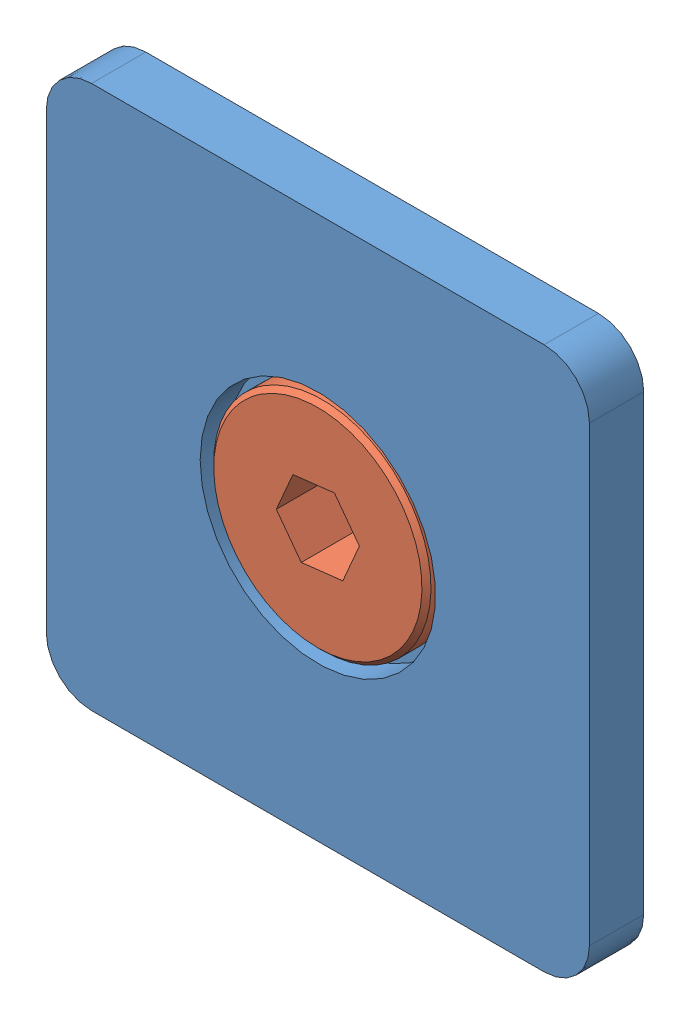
SolidWorks assembly Assem3.sldasm, configuration Default (file format 6000). Lengths in mm.
Overall size (30 30 11.5).
2 component instances, 2 part files, 2 mates.
Components (placement in the parent):
- 22.1149_2 CAP 30X30 ALU NO SCREW-1: 22.1149_2 CAP 30X30 ALU NO SCREW.sldprt [Default] at origin size (30 30 3)
- 21.1666 M8x10 Stainless-1: 21.1666 M8x10 Stainless.SLDPRT [Default] at (15 15 3) x (-0.596883 0.802328 0) z (0 0 1) size (12 12 11.5)
Mates (geometry in assembly coordinates):
- Concentric1: concentric aligned: cylinder of 22.1149_2 CAP 30X30 ALU NO SCREW-1 through (15 15 1.55) axis (0 0 -1) radius 4.25; cylinder of 21.1666 M8x10 Stainless-1 through (15 15 3) axis (0 0 -1) radius 6
- Coincident2: coincident anti-aligned: plane of 22.1149_2 CAP 30X30 ALU NO SCREW-1 through (15 15 1.5) normal (0 0 1); plane of 21.1666 M8x10 Stainless-1 through (15 15 1.5) normal (0 0 -1)
